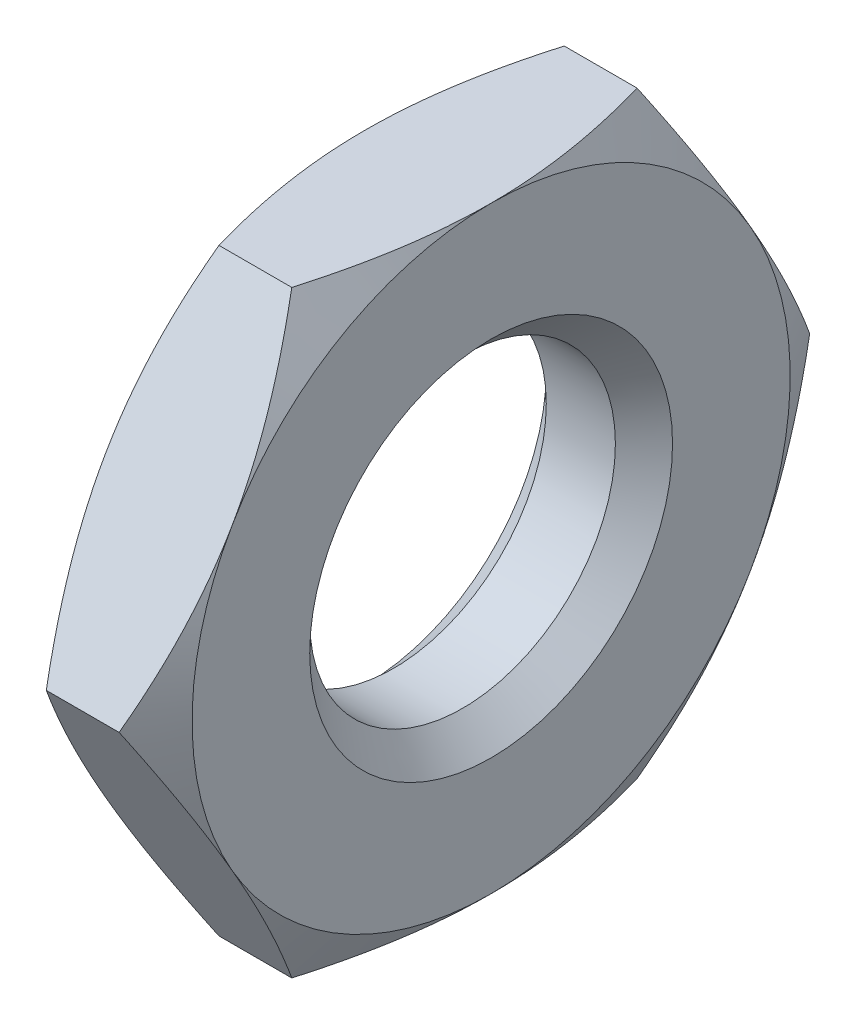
ISO-10303-21;
HEADER;
FILE_DESCRIPTION(('STEP AP214'),'2;1');
FILE_NAME('part.step','',(''),(''),'','','');
FILE_SCHEMA(('AUTOMOTIVE_DESIGN { 1 0 10303 214 1 1 1 1 }'));
ENDSEC;
DATA;
#1=APPLICATION_CONTEXT('core data for automotive mechanical design processes');
#2=APPLICATION_PROTOCOL_DEFINITION('international standard','automotive_design',2000,#1);
#3=PRODUCT_CONTEXT('',#1,'mechanical');
#4=PRODUCT('Part','Part','',(#3));
#5=PRODUCT_RELATED_PRODUCT_CATEGORY('part','',(#4));
#6=PRODUCT_DEFINITION_FORMATION('','',#4);
#7=PRODUCT_DEFINITION_CONTEXT('part definition',#1,'design');
#8=PRODUCT_DEFINITION('design','',#6,#7);
#9=PRODUCT_DEFINITION_SHAPE('','',#8);
#10=(LENGTH_UNIT() NAMED_UNIT(*) SI_UNIT(.MILLI.,.METRE.));
#11=(NAMED_UNIT(*) PLANE_ANGLE_UNIT() SI_UNIT($,.RADIAN.));
#12=(NAMED_UNIT(*) SI_UNIT($,.STERADIAN.) SOLID_ANGLE_UNIT());
#13=UNCERTAINTY_MEASURE_WITH_UNIT(LENGTH_MEASURE(1.E-05),#10,'distance_accuracy_value','');
#14=(GEOMETRIC_REPRESENTATION_CONTEXT(3) GLOBAL_UNCERTAINTY_ASSIGNED_CONTEXT((#13)) GLOBAL_UNIT_ASSIGNED_CONTEXT((#10,
#11,#12)) REPRESENTATION_CONTEXT('',''));
#15=CARTESIAN_POINT('',(0.,0.,0.));
#16=DIRECTION('',(0.,0.,1.));
#17=DIRECTION('',(1.,0.,0.));
#18=AXIS2_PLACEMENT_3D('',#15,#16,#17);
#19=CARTESIAN_POINT('',(0.95,2.25,-1.29903810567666));
#20=DIRECTION('',(1.,0.,0.));
#21=DIRECTION('',(0.,0.,-1.));
#22=AXIS2_PLACEMENT_3D('',#19,#20,#21);
#23=PLANE('',#22);
#24=CARTESIAN_POINT('',(0.95,0.,0.));
#25=DIRECTION('',(1.,0.,0.));
#26=DIRECTION('',(0.,0.,-1.));
#27=AXIS2_PLACEMENT_3D('',#24,#25,#26);
#28=CIRCLE('',#27,1.365);
#29=CARTESIAN_POINT('',(0.95,0.,-1.365));
#30=VERTEX_POINT('',#29);
#31=EDGE_CURVE('E11',#30,#30,#28,.F.);
#32=ORIENTED_EDGE('',*,*,#31,.T.);
#33=EDGE_LOOP('',(#32));
#34=FACE_BOUND('',#33,.T.);
#35=CARTESIAN_POINT('',(0.95,0.,0.));
#36=DIRECTION('',(1.,0.,0.));
#37=DIRECTION('',(0.,0.,-1.));
#38=AXIS2_PLACEMENT_3D('',#35,#36,#37);
#39=CIRCLE('',#38,2.25);
#40=CARTESIAN_POINT('',(0.95,-2.25,0.));
#41=VERTEX_POINT('',#40);
#42=CARTESIAN_POINT('',(0.95,-1.125,-1.94855715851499));
#43=VERTEX_POINT('',#42);
#44=EDGE_CURVE('E133',#41,#43,#39,.T.);
#45=ORIENTED_EDGE('',*,*,#44,.T.);
#46=CARTESIAN_POINT('',(0.95,1.125,-1.94855715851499));
#47=VERTEX_POINT('',#46);
#48=EDGE_CURVE('E122',#43,#47,#39,.T.);
#49=ORIENTED_EDGE('',*,*,#48,.T.);
#50=CARTESIAN_POINT('',(0.95,2.25,0.));
#51=VERTEX_POINT('',#50);
#52=EDGE_CURVE('E135',#47,#51,#39,.T.);
#53=ORIENTED_EDGE('',*,*,#52,.T.);
#54=CARTESIAN_POINT('',(0.95,1.125,1.94855715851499));
#55=VERTEX_POINT('',#54);
#56=EDGE_CURVE('E47',#51,#55,#39,.T.);
#57=ORIENTED_EDGE('',*,*,#56,.T.);
#58=CARTESIAN_POINT('',(0.95,-1.125,1.94855715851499));
#59=VERTEX_POINT('',#58);
#60=EDGE_CURVE('E55',#55,#59,#39,.T.);
#61=ORIENTED_EDGE('',*,*,#60,.T.);
#62=EDGE_CURVE('E155',#59,#41,#39,.T.);
#63=ORIENTED_EDGE('',*,*,#62,.T.);
#64=EDGE_LOOP('',(#45,#49,#53,#57,#61,#63));
#65=FACE_BOUND('',#64,.T.);
#66=ADVANCED_FACE('F32',(#34,#65),#23,.T.);
#67=CARTESIAN_POINT('',(0.,2.25,-1.29903810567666));
#68=DIRECTION('',(1.,0.,0.));
#69=DIRECTION('',(0.,0.,-1.));
#70=AXIS2_PLACEMENT_3D('',#67,#68,#69);
#71=PLANE('',#70);
#72=CARTESIAN_POINT('',(0.,0.,0.));
#73=DIRECTION('',(1.,0.,0.));
#74=DIRECTION('',(0.,0.,-1.));
#75=AXIS2_PLACEMENT_3D('',#72,#73,#74);
#76=CIRCLE('',#75,1.365);
#77=CARTESIAN_POINT('',(0.,0.,-1.365));
#78=VERTEX_POINT('',#77);
#79=EDGE_CURVE('E153',#78,#78,#76,.T.);
#80=ORIENTED_EDGE('',*,*,#79,.T.);
#81=EDGE_LOOP('',(#80));
#82=FACE_BOUND('',#81,.T.);
#83=CARTESIAN_POINT('',(0.,0.,0.));
#84=DIRECTION('',(1.,0.,0.));
#85=DIRECTION('',(0.,0.,-1.));
#86=AXIS2_PLACEMENT_3D('',#83,#84,#85);
#87=CIRCLE('',#86,2.25);
#88=CARTESIAN_POINT('',(0.,-1.125,-1.94855715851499));
#89=VERTEX_POINT('',#88);
#90=CARTESIAN_POINT('',(0.,1.125,-1.94855715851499));
#91=VERTEX_POINT('',#90);
#92=EDGE_CURVE('E157',#89,#91,#87,.T.);
#93=ORIENTED_EDGE('',*,*,#92,.F.);
#94=CARTESIAN_POINT('',(0.,-2.25,0.));
#95=VERTEX_POINT('',#94);
#96=EDGE_CURVE('E288',#95,#89,#87,.T.);
#97=ORIENTED_EDGE('',*,*,#96,.F.);
#98=CARTESIAN_POINT('',(0.,-1.125,1.94855715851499));
#99=VERTEX_POINT('',#98);
#100=EDGE_CURVE('E291',#99,#95,#87,.T.);
#101=ORIENTED_EDGE('',*,*,#100,.F.);
#102=CARTESIAN_POINT('',(0.,1.125,1.94855715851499));
#103=VERTEX_POINT('',#102);
#104=EDGE_CURVE('E294',#103,#99,#87,.T.);
#105=ORIENTED_EDGE('',*,*,#104,.F.);
#106=CARTESIAN_POINT('',(0.,2.25,0.));
#107=VERTEX_POINT('',#106);
#108=EDGE_CURVE('E161',#107,#103,#87,.T.);
#109=ORIENTED_EDGE('',*,*,#108,.F.);
#110=EDGE_CURVE('E158',#91,#107,#87,.T.);
#111=ORIENTED_EDGE('',*,*,#110,.F.);
#112=EDGE_LOOP('',(#93,#97,#101,#105,#109,#111));
#113=FACE_BOUND('',#112,.T.);
#114=ADVANCED_FACE('F289',(#82,#113),#71,.F.);
#115=CARTESIAN_POINT('',(0.95,0.,0.));
#116=DIRECTION('',(-1.,0.,0.));
#117=DIRECTION('',(0.,0.,1.));
#118=AXIS2_PLACEMENT_3D('',#115,#116,#117);
#119=CYLINDRICAL_SURFACE('',#118,1.15);
#120=CARTESIAN_POINT('',(0.214999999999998,0.,0.));
#121=DIRECTION('',(1.,0.,0.));
#122=DIRECTION('',(0.,0.,-1.));
#123=AXIS2_PLACEMENT_3D('',#120,#121,#122);
#124=CIRCLE('',#123,1.15);
#125=CARTESIAN_POINT('',(0.214999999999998,0.,1.15));
#126=VERTEX_POINT('',#125);
#127=EDGE_CURVE('E40',#126,#126,#124,.F.);
#128=CARTESIAN_POINT('',(0.734999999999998,0.,0.));
#129=DIRECTION('',(1.,0.,0.));
#130=DIRECTION('',(0.,0.,-1.));
#131=AXIS2_PLACEMENT_3D('',#128,#129,#130);
#132=CIRCLE('',#131,1.15);
#133=CARTESIAN_POINT('',(0.734999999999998,0.,1.15));
#134=VERTEX_POINT('',#133);
#135=EDGE_CURVE('E357',#134,#134,#132,.T.);
#136=CARTESIAN_POINT('',(0.214999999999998,0.,1.15));
#137=CARTESIAN_POINT('',(0.220416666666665,0.,1.15));
#138=CARTESIAN_POINT('',(0.225833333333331,0.,1.15));
#139=CARTESIAN_POINT('',(0.236666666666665,0.,1.15));
#140=CARTESIAN_POINT('',(0.242083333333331,0.,1.15));
#141=CARTESIAN_POINT('',(0.252916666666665,0.,1.15));
#142=CARTESIAN_POINT('',(0.258333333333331,0.,1.15));
#143=CARTESIAN_POINT('',(0.269166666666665,0.,1.15));
#144=CARTESIAN_POINT('',(0.274583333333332,0.,1.15));
#145=CARTESIAN_POINT('',(0.285416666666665,0.,1.15));
#146=CARTESIAN_POINT('',(0.290833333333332,0.,1.15));
#147=CARTESIAN_POINT('',(0.301666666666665,0.,1.15));
#148=CARTESIAN_POINT('',(0.307083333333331,0.,1.15));
#149=CARTESIAN_POINT('',(0.317916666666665,0.,1.15));
#150=CARTESIAN_POINT('',(0.323333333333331,0.,1.15));
#151=CARTESIAN_POINT('',(0.334166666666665,0.,1.15));
#152=CARTESIAN_POINT('',(0.339583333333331,0.,1.15));
#153=CARTESIAN_POINT('',(0.350416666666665,0.,1.15));
#154=CARTESIAN_POINT('',(0.355833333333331,0.,1.15));
#155=CARTESIAN_POINT('',(0.366666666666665,0.,1.15));
#156=CARTESIAN_POINT('',(0.372083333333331,0.,1.15));
#157=CARTESIAN_POINT('',(0.382916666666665,0.,1.15));
#158=CARTESIAN_POINT('',(0.388333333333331,0.,1.15));
#159=CARTESIAN_POINT('',(0.399166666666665,0.,1.15));
#160=CARTESIAN_POINT('',(0.404583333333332,0.,1.15));
#161=CARTESIAN_POINT('',(0.415416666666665,0.,1.15));
#162=CARTESIAN_POINT('',(0.420833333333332,0.,1.15));
#163=CARTESIAN_POINT('',(0.431666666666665,0.,1.15));
#164=CARTESIAN_POINT('',(0.437083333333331,0.,1.15));
#165=CARTESIAN_POINT('',(0.447916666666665,0.,1.15));
#166=CARTESIAN_POINT('',(0.453333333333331,0.,1.15));
#167=CARTESIAN_POINT('',(0.464166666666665,0.,1.15));
#168=CARTESIAN_POINT('',(0.469583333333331,0.,1.15));
#169=CARTESIAN_POINT('',(0.480416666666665,0.,1.15));
#170=CARTESIAN_POINT('',(0.485833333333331,0.,1.15));
#171=CARTESIAN_POINT('',(0.496666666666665,0.,1.15));
#172=CARTESIAN_POINT('',(0.502083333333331,0.,1.15));
#173=CARTESIAN_POINT('',(0.512916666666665,0.,1.15));
#174=CARTESIAN_POINT('',(0.518333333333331,0.,1.15));
#175=CARTESIAN_POINT('',(0.529166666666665,0.,1.15));
#176=CARTESIAN_POINT('',(0.534583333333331,0.,1.15));
#177=CARTESIAN_POINT('',(0.545416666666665,0.,1.15));
#178=CARTESIAN_POINT('',(0.550833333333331,0.,1.15));
#179=CARTESIAN_POINT('',(0.561666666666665,0.,1.15));
#180=CARTESIAN_POINT('',(0.567083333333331,0.,1.15));
#181=CARTESIAN_POINT('',(0.577916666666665,0.,1.15));
#182=CARTESIAN_POINT('',(0.583333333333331,0.,1.15));
#183=CARTESIAN_POINT('',(0.594166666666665,0.,1.15));
#184=CARTESIAN_POINT('',(0.599583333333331,0.,1.15));
#185=CARTESIAN_POINT('',(0.610416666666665,0.,1.15));
#186=CARTESIAN_POINT('',(0.615833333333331,0.,1.15));
#187=CARTESIAN_POINT('',(0.626666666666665,0.,1.15));
#188=CARTESIAN_POINT('',(0.632083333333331,0.,1.15));
#189=CARTESIAN_POINT('',(0.642916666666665,0.,1.15));
#190=CARTESIAN_POINT('',(0.648333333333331,0.,1.15));
#191=CARTESIAN_POINT('',(0.659166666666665,0.,1.15));
#192=CARTESIAN_POINT('',(0.664583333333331,0.,1.15));
#193=CARTESIAN_POINT('',(0.675416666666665,0.,1.15));
#194=CARTESIAN_POINT('',(0.680833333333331,0.,1.15));
#195=CARTESIAN_POINT('',(0.691666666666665,0.,1.15));
#196=CARTESIAN_POINT('',(0.697083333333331,0.,1.15));
#197=CARTESIAN_POINT('',(0.707916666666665,0.,1.15));
#198=CARTESIAN_POINT('',(0.713333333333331,0.,1.15));
#199=CARTESIAN_POINT('',(0.724166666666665,0.,1.15));
#200=CARTESIAN_POINT('',(0.729583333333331,0.,1.15));
#201=CARTESIAN_POINT('',(0.734999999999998,0.,1.15));
#202=B_SPLINE_CURVE_WITH_KNOTS('',3,(#136,#137,#138,#139,#140,#141,#142,#143,#144,#145,#146,
#147,#148,#149,#150,#151,#152,#153,#154,#155,#156,#157,#158,#159,#160,#161,#162,#163,#164,#165,
#166,#167,#168,#169,#170,#171,#172,#173,#174,#175,#176,#177,#178,#179,#180,#181,#182,#183,#184,
#185,#186,#187,#188,#189,#190,#191,#192,#193,#194,#195,#196,#197,#198,#199,#200,#201),
.UNSPECIFIED.,.F.,.F.,(4,2,2,2,2,2,2,2,2,2,2,2,2,2,2,2,2,2,2,2,2,2,2,2,2,2,2,2,2,2,2,2,4),(0.,
0.01625,0.0325,0.04875,0.0649999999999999,0.0812499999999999,0.0974999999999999,0.11375,0.13,
0.14625,0.1625,0.17875,0.195,0.21125,0.2275,0.24375,0.26,0.27625,0.2925,0.30875,0.325,0.34125,
0.3575,0.37375,0.39,0.40625,0.4225,0.43875,0.455,0.47125,0.4875,0.50375,0.52),.UNSPECIFIED.);
#203=EDGE_CURVE('BSEAM215',#126,#134,#202,.T.);
#204=ORIENTED_EDGE('',*,*,#127,.T.);
#205=ORIENTED_EDGE('',*,*,#135,.T.);
#206=ORIENTED_EDGE('',*,*,#203,.T.);
#207=ORIENTED_EDGE('',*,*,#203,.F.);
#208=EDGE_LOOP('',(#204,#206,#205,#207));
#209=FACE_BOUND('',#208,.T.);
#210=ADVANCED_FACE('F215',(#209),#119,.F.);
#211=CARTESIAN_POINT('',(0.,0.,0.));
#212=DIRECTION('',(1.,0.,0.));
#213=DIRECTION('',(0.,0.,-1.));
#214=AXIS2_PLACEMENT_3D('',#211,#212,#213);
#215=CONICAL_SURFACE('',#214,2.25,1.0471975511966);
#216=CARTESIAN_POINT('',(0.201028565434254,-2.2502,-1.29892263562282));
#217=CARTESIAN_POINT('',(0.168055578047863,-2.15132275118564,-1.35600944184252));
#218=CARTESIAN_POINT('',(0.138067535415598,-2.05159200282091,-1.41358901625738));
#219=CARTESIAN_POINT('',(0.0857223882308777,-1.85040345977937,-1.52974527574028));
#220=CARTESIAN_POINT('',(0.0633838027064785,-1.74894208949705,-1.58832402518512));
#221=CARTESIAN_POINT('',(0.0286095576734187,-1.54727681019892,-1.7047555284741));
#222=CARTESIAN_POINT('',(0.0159424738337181,-1.44710393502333,-1.76259036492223));
#223=CARTESIAN_POINT('',(0.000818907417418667,-1.24628668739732,-1.87853225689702));
#224=CARTESIAN_POINT('',(-0.00165009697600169,-1.1456430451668,-1.93663889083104));
#225=CARTESIAN_POINT('',(0.003478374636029,-0.957574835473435,-2.04522012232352));
#226=CARTESIAN_POINT('',(0.00981663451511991,-0.870122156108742,-2.09571095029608));
#227=CARTESIAN_POINT('',(0.0299076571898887,-0.695786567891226,-2.19636364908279));
#228=CARTESIAN_POINT('',(0.0436672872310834,-0.608904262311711,-2.24652517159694));
#229=CARTESIAN_POINT('',(0.0780662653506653,-0.434209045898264,-2.34738550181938));
#230=CARTESIAN_POINT('',(0.0988514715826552,-0.346418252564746,-2.39807153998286));
#231=CARTESIAN_POINT('',(0.146026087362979,-0.172146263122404,-2.49868751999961));
#232=CARTESIAN_POINT('',(0.172404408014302,-0.0856628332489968,-2.54861875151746));
#233=CARTESIAN_POINT('',(0.201028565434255,0.00020000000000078,-2.59819168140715));
#234=B_SPLINE_CURVE_WITH_KNOTS('',3,(#216,#217,#218,#219,#220,#221,#222,#223,#224,#225,#226,
#227,#228,#229,#230,#231,#232,#233),.UNSPECIFIED.,.F.,.F.,(4,2,2,2,2,2,2,2,4),(0.,
0.356658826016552,0.714175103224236,1.06284241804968,1.41108149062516,1.71433394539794,
2.01786749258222,2.32813511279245,2.63779325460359),.UNSPECIFIED.);
#235=CARTESIAN_POINT('',(0.200961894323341,0.,-2.59807621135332));
#236=VERTEX_POINT('',#235);
#237=EDGE_CURVE('E299',#89,#236,#234,.T.);
#238=ORIENTED_EDGE('',*,*,#237,.F.);
#239=ORIENTED_EDGE('',*,*,#92,.T.);
#240=CARTESIAN_POINT('',(0.201028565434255,-0.000199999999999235,-2.59819168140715));
#241=CARTESIAN_POINT('',(0.168055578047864,0.098677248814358,-2.54110487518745));
#242=CARTESIAN_POINT('',(0.138067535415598,0.198407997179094,-2.48352530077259));
#243=CARTESIAN_POINT('',(0.085722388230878,0.399596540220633,-2.36736904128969));
#244=CARTESIAN_POINT('',(0.0633838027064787,0.501057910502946,-2.30879029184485));
#245=CARTESIAN_POINT('',(0.0286095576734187,0.702723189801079,-2.19235878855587));
#246=CARTESIAN_POINT('',(0.0159424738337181,0.802896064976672,-2.13452395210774));
#247=CARTESIAN_POINT('',(0.000818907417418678,1.00371331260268,-2.01858206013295));
#248=CARTESIAN_POINT('',(-0.00165009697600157,1.1043569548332,-1.96047542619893));
#249=CARTESIAN_POINT('',(0.00347837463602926,1.29242516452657,-1.85189419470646));
#250=CARTESIAN_POINT('',(0.0098166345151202,1.37987784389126,-1.8014033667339));
#251=CARTESIAN_POINT('',(0.0299076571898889,1.55421343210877,-1.70075066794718));
#252=CARTESIAN_POINT('',(0.0436672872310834,1.64109573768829,-1.65058914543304));
#253=CARTESIAN_POINT('',(0.0780662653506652,1.81579095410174,-1.54972881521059));
#254=CARTESIAN_POINT('',(0.0988514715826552,1.90358174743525,-1.49904277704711));
#255=CARTESIAN_POINT('',(0.146026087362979,2.07785373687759,-1.39842679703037));
#256=CARTESIAN_POINT('',(0.172404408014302,2.164337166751,-1.34849556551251));
#257=CARTESIAN_POINT('',(0.201028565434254,2.2502,-1.29892263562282));
#258=B_SPLINE_CURVE_WITH_KNOTS('',3,(#240,#241,#242,#243,#244,#245,#246,#247,#248,#249,#250,
#251,#252,#253,#254,#255,#256,#257),.UNSPECIFIED.,.F.,.F.,(4,2,2,2,2,2,2,2,4),(0.,
0.356658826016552,0.714175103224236,1.06284241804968,1.41108149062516,1.71433394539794,
2.01786749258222,2.32813511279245,2.63779325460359),.UNSPECIFIED.);
#259=EDGE_CURVE('E196',#236,#91,#258,.T.);
#260=ORIENTED_EDGE('',*,*,#259,.F.);
#261=EDGE_LOOP('',(#238,#239,#260));
#262=FACE_BOUND('',#261,.T.);
#263=ADVANCED_FACE('F176',(#262),#215,.T.);
#264=ORIENTED_EDGE('',*,*,#96,.T.);
#265=CARTESIAN_POINT('',(0.200961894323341,-2.25,-1.29903810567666));
#266=VERTEX_POINT('',#265);
#267=EDGE_CURVE('E146',#266,#89,#234,.T.);
#268=ORIENTED_EDGE('',*,*,#267,.F.);
#269=CARTESIAN_POINT('',(1.09515937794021,-2.25,-3.48339558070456));
#270=CARTESIAN_POINT('',(1.04753772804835,-2.25,-3.38517513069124));
#271=CARTESIAN_POINT('',(1.00037441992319,-2.25,-3.28672856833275));
#272=CARTESIAN_POINT('',(0.907222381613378,-2.25,-3.0892629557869));
#273=CARTESIAN_POINT('',(0.861233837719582,-2.25,-2.99024381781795));
#274=CARTESIAN_POINT('',(0.770456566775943,-2.25,-2.79099972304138));
#275=CARTESIAN_POINT('',(0.725675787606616,-2.25,-2.69077113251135));
#276=CARTESIAN_POINT('',(0.63795475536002,-2.25,-2.48951469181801));
#277=CARTESIAN_POINT('',(0.595014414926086,-2.25,-2.3884868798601));
#278=CARTESIAN_POINT('',(0.510126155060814,-2.25,-2.18222958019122));
#279=CARTESIAN_POINT('',(0.468253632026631,-2.25,-2.07696889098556));
#280=CARTESIAN_POINT('',(0.387692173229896,-2.25,-1.86521378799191));
#281=CARTESIAN_POINT('',(0.349003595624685,-2.25,-1.75871923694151));
#282=CARTESIAN_POINT('',(0.275830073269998,-2.25,-1.54452830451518));
#283=CARTESIAN_POINT('',(0.241336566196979,-2.25,-1.43683487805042));
#284=CARTESIAN_POINT('',(0.177664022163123,-2.25,-1.21990320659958));
#285=CARTESIAN_POINT('',(0.148483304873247,-2.25,-1.11066546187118));
#286=CARTESIAN_POINT('',(0.096996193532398,-2.25,-0.891190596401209));
#287=CARTESIAN_POINT('',(0.0746526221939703,-2.25,-0.780962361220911));
#288=CARTESIAN_POINT('',(0.0381060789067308,-2.25,-0.559141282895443));
#289=CARTESIAN_POINT('',(0.0239023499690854,-2.25,-0.447548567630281));
#290=CARTESIAN_POINT('',(0.00495462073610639,-2.25,-0.225010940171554));
#291=CARTESIAN_POINT('',(8.9504677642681E-05,-2.25,-0.114076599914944));
#292=CARTESIAN_POINT('',(-8.69843550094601E-05,-2.25,0.107808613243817));
#293=CARTESIAN_POINT('',(0.00460183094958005,-2.25,0.218759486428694));
#294=CARTESIAN_POINT('',(0.0203569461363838,-2.25,0.407300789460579));
#295=CARTESIAN_POINT('',(0.0291386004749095,-2.25,0.485093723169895));
#296=CARTESIAN_POINT('',(0.0508485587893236,-2.25,0.640104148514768));
#297=CARTESIAN_POINT('',(0.0637774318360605,-2.25,0.71732155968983));
#298=CARTESIAN_POINT('',(0.108106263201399,-2.25,0.94800218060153));
#299=CARTESIAN_POINT('',(0.145040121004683,-2.25,1.10040586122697));
#300=CARTESIAN_POINT('',(0.230601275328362,-2.25,1.40538758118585));
#301=CARTESIAN_POINT('',(0.279467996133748,-2.25,1.55789566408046));
#302=CARTESIAN_POINT('',(0.38500480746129,-2.25,1.86009764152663));
#303=CARTESIAN_POINT('',(0.441672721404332,-2.25,2.00979230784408));
#304=CARTESIAN_POINT('',(0.540622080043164,-2.25,2.25734757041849));
#305=CARTESIAN_POINT('',(0.581388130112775,-2.25,2.35582380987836));
#306=CARTESIAN_POINT('',(0.664851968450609,-2.25,2.55195610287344));
#307=CARTESIAN_POINT('',(0.707549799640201,-2.25,2.64961213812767));
#308=CARTESIAN_POINT('',(0.837950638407,-2.25,2.94159317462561));
#309=CARTESIAN_POINT('',(0.927945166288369,-2.25,3.13489245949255));
#310=CARTESIAN_POINT('',(1.11201833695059,-2.25,3.51974780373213));
#311=CARTESIAN_POINT('',(1.20610087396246,-2.25,3.71130198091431));
#312=CARTESIAN_POINT('',(1.39702905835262,-2.25,4.09303245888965));
#313=CARTESIAN_POINT('',(1.49387479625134,-2.25,4.28320871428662));
#314=CARTESIAN_POINT('',(1.68154183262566,-2.25,4.64706067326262));
#315=CARTESIAN_POINT('',(1.77220945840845,-2.25,4.82081590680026));
#316=CARTESIAN_POINT('',(1.95479522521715,-2.25,5.16767471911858));
#317=CARTESIAN_POINT('',(2.04671340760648,-2.25,5.34077827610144));
#318=CARTESIAN_POINT('',(2.23128403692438,-2.25,5.68606019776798));
#319=CARTESIAN_POINT('',(2.32393419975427,-2.25,5.85823978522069));
#320=CARTESIAN_POINT('',(2.50998657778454,-2.25,6.20218051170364));
#321=CARTESIAN_POINT('',(2.60338875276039,-2.25,6.37394167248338));
#322=CARTESIAN_POINT('',(2.69707247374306,-2.25,6.54554805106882));
#323=B_SPLINE_CURVE_WITH_KNOTS('',3,(#269,#270,#271,#272,#273,#274,#275,#276,#277,#278,#279,
#280,#281,#282,#283,#284,#285,#286,#287,#288,#289,#290,#291,#292,#293,#294,#295,#296,#297,#298,
#299,#300,#301,#302,#303,#304,#305,#306,#307,#308,#309,#310,#311,#312,#313,#314,#315,#316,#317,
#318,#319,#320,#321,#322),.UNSPECIFIED.,.F.,.F.,(4,2,2,2,2,2,2,2,2,2,2,2,2,2,2,2,2,2,2,2,2,2,2,
2,2,2,4),(0.,0.327472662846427,0.654996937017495,0.984314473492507,1.31361636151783,
1.65342665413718,1.99327511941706,2.33241786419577,2.67145315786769,3.00861075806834,
3.34573699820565,3.67846057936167,4.01119071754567,4.24593859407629,4.48071869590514,
4.9505425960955,5.43070470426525,5.91073311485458,6.2304559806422,6.55018595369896,
7.18977111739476,7.82997951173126,8.47020890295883,9.05816850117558,9.64614759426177,
10.2327193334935,10.819259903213),.UNSPECIFIED.);
#324=EDGE_CURVE('E160',#95,#266,#323,.F.);
#325=ORIENTED_EDGE('',*,*,#324,.F.);
#326=EDGE_LOOP('',(#264,#268,#325));
#327=FACE_BOUND('',#326,.T.);
#328=ADVANCED_FACE('F312',(#327),#215,.T.);
#329=CARTESIAN_POINT('',(0.475,0.,0.));
#330=DIRECTION('',(-1.,0.,0.));
#331=DIRECTION('',(0.,0.,1.));
#332=AXIS2_PLACEMENT_3D('',#329,#330,#331);
#333=CONICAL_SURFACE('',#332,3.07272413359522,1.0471975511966);
#334=CARTESIAN_POINT('',(0.748971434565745,0.000200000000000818,-2.59819168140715));
#335=CARTESIAN_POINT('',(0.781944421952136,-0.0986772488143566,-2.54110487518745));
#336=CARTESIAN_POINT('',(0.811932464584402,-0.198407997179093,-2.48352530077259));
#337=CARTESIAN_POINT('',(0.864277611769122,-0.399596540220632,-2.36736904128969));
#338=CARTESIAN_POINT('',(0.886616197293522,-0.501057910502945,-2.30879029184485));
#339=CARTESIAN_POINT('',(0.921390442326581,-0.702723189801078,-2.19235878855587));
#340=CARTESIAN_POINT('',(0.934057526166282,-0.802896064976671,-2.13452395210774));
#341=CARTESIAN_POINT('',(0.949181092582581,-1.00371331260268,-2.01858206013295));
#342=CARTESIAN_POINT('',(0.951650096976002,-1.1043569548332,-1.96047542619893));
#343=CARTESIAN_POINT('',(0.946521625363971,-1.29242516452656,-1.85189419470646));
#344=CARTESIAN_POINT('',(0.94018336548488,-1.37987784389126,-1.8014033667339));
#345=CARTESIAN_POINT('',(0.920092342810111,-1.55421343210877,-1.70075066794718));
#346=CARTESIAN_POINT('',(0.906332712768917,-1.64109573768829,-1.65058914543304));
#347=CARTESIAN_POINT('',(0.871933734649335,-1.81579095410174,-1.54972881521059));
#348=CARTESIAN_POINT('',(0.851148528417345,-1.90358174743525,-1.49904277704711));
#349=CARTESIAN_POINT('',(0.803973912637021,-2.07785373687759,-1.39842679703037));
#350=CARTESIAN_POINT('',(0.777595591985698,-2.164337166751,-1.34849556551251));
#351=CARTESIAN_POINT('',(0.748971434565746,-2.2502,-1.29892263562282));
#352=B_SPLINE_CURVE_WITH_KNOTS('',3,(#334,#335,#336,#337,#338,#339,#340,#341,#342,#343,#344,
#345,#346,#347,#348,#349,#350,#351),.UNSPECIFIED.,.F.,.F.,(4,2,2,2,2,2,2,2,4),(0.,
0.356658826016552,0.714175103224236,1.06284241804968,1.41108149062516,1.71433394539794,
2.01786749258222,2.32813511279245,2.63779325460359),.UNSPECIFIED.);
#353=CARTESIAN_POINT('',(0.749038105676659,-2.25,-1.29903810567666));
#354=VERTEX_POINT('',#353);
#355=EDGE_CURVE('E138',#43,#354,#352,.T.);
#356=ORIENTED_EDGE('',*,*,#355,.F.);
#357=ORIENTED_EDGE('',*,*,#44,.F.);
#358=CARTESIAN_POINT('',(-0.145159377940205,-2.25,-3.48339558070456));
#359=CARTESIAN_POINT('',(-0.0975377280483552,-2.25,-3.38517513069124));
#360=CARTESIAN_POINT('',(-0.050374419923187,-2.25,-3.28672856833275));
#361=CARTESIAN_POINT('',(0.0427776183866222,-2.25,-3.0892629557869));
#362=CARTESIAN_POINT('',(0.0887661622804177,-2.25,-2.99024381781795));
#363=CARTESIAN_POINT('',(0.179543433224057,-2.25,-2.79099972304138));
#364=CARTESIAN_POINT('',(0.224324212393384,-2.25,-2.69077113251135));
#365=CARTESIAN_POINT('',(0.31204524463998,-2.25,-2.48951469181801));
#366=CARTESIAN_POINT('',(0.354985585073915,-2.25,-2.3884868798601));
#367=CARTESIAN_POINT('',(0.439873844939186,-2.25,-2.18222958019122));
#368=CARTESIAN_POINT('',(0.481746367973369,-2.25,-2.07696889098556));
#369=CARTESIAN_POINT('',(0.562307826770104,-2.25,-1.86521378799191));
#370=CARTESIAN_POINT('',(0.600996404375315,-2.25,-1.75871923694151));
#371=CARTESIAN_POINT('',(0.674169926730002,-2.25,-1.54452830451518));
#372=CARTESIAN_POINT('',(0.708663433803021,-2.25,-1.43683487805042));
#373=CARTESIAN_POINT('',(0.772335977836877,-2.25,-1.21990320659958));
#374=CARTESIAN_POINT('',(0.801516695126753,-2.25,-1.11066546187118));
#375=CARTESIAN_POINT('',(0.853003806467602,-2.25,-0.891190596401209));
#376=CARTESIAN_POINT('',(0.87534737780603,-2.25,-0.780962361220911));
#377=CARTESIAN_POINT('',(0.911893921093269,-2.25,-0.559141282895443));
#378=CARTESIAN_POINT('',(0.926097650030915,-2.25,-0.447548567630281));
#379=CARTESIAN_POINT('',(0.945045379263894,-2.25,-0.225010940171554));
#380=CARTESIAN_POINT('',(0.949910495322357,-2.25,-0.114076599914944));
#381=CARTESIAN_POINT('',(0.95008698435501,-2.25,0.107808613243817));
#382=CARTESIAN_POINT('',(0.94539816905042,-2.25,0.218759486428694));
#383=CARTESIAN_POINT('',(0.929643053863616,-2.25,0.407300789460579));
#384=CARTESIAN_POINT('',(0.920861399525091,-2.25,0.485093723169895));
#385=CARTESIAN_POINT('',(0.899151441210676,-2.25,0.640104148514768));
#386=CARTESIAN_POINT('',(0.88622256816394,-2.25,0.71732155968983));
#387=CARTESIAN_POINT('',(0.841893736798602,-2.25,0.94800218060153));
#388=CARTESIAN_POINT('',(0.804959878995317,-2.25,1.10040586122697));
#389=CARTESIAN_POINT('',(0.719398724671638,-2.25,1.40538758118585));
#390=CARTESIAN_POINT('',(0.670532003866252,-2.25,1.55789566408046));
#391=CARTESIAN_POINT('',(0.56499519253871,-2.25,1.86009764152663));
#392=CARTESIAN_POINT('',(0.508327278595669,-2.25,2.00979230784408));
#393=CARTESIAN_POINT('',(0.409377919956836,-2.25,2.25734757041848));
#394=CARTESIAN_POINT('',(0.368611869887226,-2.25,2.35582380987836));
#395=CARTESIAN_POINT('',(0.285148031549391,-2.25,2.55195610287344));
#396=CARTESIAN_POINT('',(0.2424502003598,-2.25,2.64961213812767));
#397=CARTESIAN_POINT('',(0.112049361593,-2.25,2.94159317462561));
#398=CARTESIAN_POINT('',(0.0220548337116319,-2.25,3.13489245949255));
#399=CARTESIAN_POINT('',(-0.162018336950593,-2.25,3.51974780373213));
#400=CARTESIAN_POINT('',(-0.256100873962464,-2.25,3.71130198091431));
#401=CARTESIAN_POINT('',(-0.44702905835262,-2.25,4.09303245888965));
#402=CARTESIAN_POINT('',(-0.543874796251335,-2.25,4.28320871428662));
#403=CARTESIAN_POINT('',(-0.731541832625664,-2.25,4.64706067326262));
#404=CARTESIAN_POINT('',(-0.822209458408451,-2.25,4.82081590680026));
#405=CARTESIAN_POINT('',(-1.00479522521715,-2.25,5.16767471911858));
#406=CARTESIAN_POINT('',(-1.09671340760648,-2.25,5.34077827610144));
#407=CARTESIAN_POINT('',(-1.28128403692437,-2.25,5.68606019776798));
#408=CARTESIAN_POINT('',(-1.37393419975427,-2.25,5.85823978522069));
#409=CARTESIAN_POINT('',(-1.55998657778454,-2.25,6.20218051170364));
#410=CARTESIAN_POINT('',(-1.65338875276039,-2.25,6.37394167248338));
#411=CARTESIAN_POINT('',(-1.74707247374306,-2.25,6.54554805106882));
#412=B_SPLINE_CURVE_WITH_KNOTS('',3,(#358,#359,#360,#361,#362,#363,#364,#365,#366,#367,#368,
#369,#370,#371,#372,#373,#374,#375,#376,#377,#378,#379,#380,#381,#382,#383,#384,#385,#386,#387,
#388,#389,#390,#391,#392,#393,#394,#395,#396,#397,#398,#399,#400,#401,#402,#403,#404,#405,#406,
#407,#408,#409,#410,#411),.UNSPECIFIED.,.F.,.F.,(4,2,2,2,2,2,2,2,2,2,2,2,2,2,2,2,2,2,2,2,2,2,2,
2,2,2,4),(0.,0.327472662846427,0.654996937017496,0.984314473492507,1.31361636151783,
1.65342665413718,1.99327511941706,2.33241786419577,2.67145315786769,3.00861075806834,
3.34573699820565,3.67846057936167,4.01119071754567,4.24593859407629,4.48071869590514,
4.9505425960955,5.43070470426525,5.91073311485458,6.2304559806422,6.55018595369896,
7.18977111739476,7.82997951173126,8.47020890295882,9.05816850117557,9.64614759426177,
10.2327193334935,10.819259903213),.UNSPECIFIED.);
#413=EDGE_CURVE('E142',#354,#41,#412,.T.);
#414=ORIENTED_EDGE('',*,*,#413,.F.);
#415=EDGE_LOOP('',(#356,#357,#414));
#416=FACE_BOUND('',#415,.T.);
#417=ADVANCED_FACE('F139',(#416),#333,.T.);
#418=ORIENTED_EDGE('',*,*,#48,.F.);
#419=CARTESIAN_POINT('',(0.749038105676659,0.,-2.59807621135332));
#420=VERTEX_POINT('',#419);
#421=EDGE_CURVE('E126',#420,#43,#352,.T.);
#422=ORIENTED_EDGE('',*,*,#421,.F.);
#423=CARTESIAN_POINT('',(0.748971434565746,2.2502,-1.29892263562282));
#424=CARTESIAN_POINT('',(0.781944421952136,2.15132275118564,-1.35600944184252));
#425=CARTESIAN_POINT('',(0.811932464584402,2.05159200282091,-1.41358901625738));
#426=CARTESIAN_POINT('',(0.864277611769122,1.85040345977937,-1.52974527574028));
#427=CARTESIAN_POINT('',(0.886616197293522,1.74894208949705,-1.58832402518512));
#428=CARTESIAN_POINT('',(0.921390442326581,1.54727681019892,-1.7047555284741));
#429=CARTESIAN_POINT('',(0.934057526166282,1.44710393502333,-1.76259036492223));
#430=CARTESIAN_POINT('',(0.949181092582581,1.24628668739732,-1.87853225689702));
#431=CARTESIAN_POINT('',(0.951650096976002,1.1456430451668,-1.93663889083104));
#432=CARTESIAN_POINT('',(0.946521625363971,0.957574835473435,-2.04522012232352));
#433=CARTESIAN_POINT('',(0.94018336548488,0.870122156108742,-2.09571095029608));
#434=CARTESIAN_POINT('',(0.920092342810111,0.695786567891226,-2.19636364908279));
#435=CARTESIAN_POINT('',(0.906332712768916,0.608904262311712,-2.24652517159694));
#436=CARTESIAN_POINT('',(0.871933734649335,0.434209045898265,-2.34738550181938));
#437=CARTESIAN_POINT('',(0.851148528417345,0.346418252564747,-2.39807153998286));
#438=CARTESIAN_POINT('',(0.803973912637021,0.172146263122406,-2.49868751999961));
#439=CARTESIAN_POINT('',(0.777595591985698,0.0856628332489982,-2.54861875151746));
#440=CARTESIAN_POINT('',(0.748971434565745,-0.000199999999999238,-2.59819168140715));
#441=B_SPLINE_CURVE_WITH_KNOTS('',3,(#423,#424,#425,#426,#427,#428,#429,#430,#431,#432,#433,
#434,#435,#436,#437,#438,#439,#440),.UNSPECIFIED.,.F.,.F.,(4,2,2,2,2,2,2,2,4),(0.,
0.356658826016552,0.714175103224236,1.06284241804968,1.41108149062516,1.71433394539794,
2.01786749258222,2.32813511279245,2.63779325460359),.UNSPECIFIED.);
#442=EDGE_CURVE('E128',#47,#420,#441,.T.);
#443=ORIENTED_EDGE('',*,*,#442,.F.);
#444=EDGE_LOOP('',(#418,#422,#443));
#445=FACE_BOUND('',#444,.T.);
#446=ADVANCED_FACE('F124',(#445),#333,.T.);
#447=ORIENTED_EDGE('',*,*,#100,.T.);
#448=CARTESIAN_POINT('',(0.20096189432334,-2.25,1.29903810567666));
#449=VERTEX_POINT('',#448);
#450=EDGE_CURVE('E169',#449,#95,#323,.F.);
#451=ORIENTED_EDGE('',*,*,#450,.F.);
#452=CARTESIAN_POINT('',(0.201028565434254,0.000200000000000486,2.59819168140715));
#453=CARTESIAN_POINT('',(0.168055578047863,-0.0986772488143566,2.54110487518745));
#454=CARTESIAN_POINT('',(0.138067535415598,-0.198407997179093,2.48352530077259));
#455=CARTESIAN_POINT('',(0.0857223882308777,-0.399596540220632,2.36736904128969));
#456=CARTESIAN_POINT('',(0.0633838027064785,-0.501057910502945,2.30879029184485));
#457=CARTESIAN_POINT('',(0.0286095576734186,-0.702723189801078,2.19235878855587));
#458=CARTESIAN_POINT('',(0.015942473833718,-0.802896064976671,2.13452395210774));
#459=CARTESIAN_POINT('',(0.000818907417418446,-1.00371331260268,2.01858206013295));
#460=CARTESIAN_POINT('',(-0.00165009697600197,-1.1043569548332,1.96047542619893));
#461=CARTESIAN_POINT('',(0.00347837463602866,-1.29242516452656,1.85189419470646));
#462=CARTESIAN_POINT('',(0.00981663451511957,-1.37987784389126,1.8014033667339));
#463=CARTESIAN_POINT('',(0.0299076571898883,-1.55421343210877,1.70075066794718));
#464=CARTESIAN_POINT('',(0.0436672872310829,-1.64109573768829,1.65058914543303));
#465=CARTESIAN_POINT('',(0.0780662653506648,-1.81579095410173,1.54972881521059));
#466=CARTESIAN_POINT('',(0.0988514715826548,-1.90358174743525,1.49904277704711));
#467=CARTESIAN_POINT('',(0.146026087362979,-2.07785373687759,1.39842679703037));
#468=CARTESIAN_POINT('',(0.172404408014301,-2.164337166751,1.34849556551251));
#469=CARTESIAN_POINT('',(0.201028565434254,-2.2502,1.29892263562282));
#470=B_SPLINE_CURVE_WITH_KNOTS('',3,(#452,#453,#454,#455,#456,#457,#458,#459,#460,#461,#462,
#463,#464,#465,#466,#467,#468,#469),.UNSPECIFIED.,.F.,.F.,(4,2,2,2,2,2,2,2,4),(0.,
0.356658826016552,0.714175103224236,1.06284241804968,1.41108149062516,1.71433394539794,
2.01786749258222,2.32813511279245,2.63779325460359),.UNSPECIFIED.);
#471=EDGE_CURVE('E170',#99,#449,#470,.T.);
#472=ORIENTED_EDGE('',*,*,#471,.F.);
#473=EDGE_LOOP('',(#447,#451,#472));
#474=FACE_BOUND('',#473,.T.);
#475=ADVANCED_FACE('F311',(#474),#215,.T.);
#476=CARTESIAN_POINT('',(0.74903810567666,-2.25,1.29903810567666));
#477=VERTEX_POINT('',#476);
#478=EDGE_CURVE('E197',#41,#477,#412,.T.);
#479=ORIENTED_EDGE('',*,*,#478,.F.);
#480=ORIENTED_EDGE('',*,*,#62,.F.);
#481=CARTESIAN_POINT('',(0.748971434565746,-2.2502,1.29892263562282));
#482=CARTESIAN_POINT('',(0.781944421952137,-2.15132275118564,1.35600944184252));
#483=CARTESIAN_POINT('',(0.811932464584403,-2.05159200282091,1.41358901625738));
#484=CARTESIAN_POINT('',(0.864277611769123,-1.85040345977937,1.52974527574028));
#485=CARTESIAN_POINT('',(0.886616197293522,-1.74894208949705,1.58832402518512));
#486=CARTESIAN_POINT('',(0.921390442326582,-1.54727681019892,1.7047555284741));
#487=CARTESIAN_POINT('',(0.934057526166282,-1.44710393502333,1.76259036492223));
#488=CARTESIAN_POINT('',(0.949181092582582,-1.24628668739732,1.87853225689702));
#489=CARTESIAN_POINT('',(0.951650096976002,-1.1456430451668,1.93663889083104));
#490=CARTESIAN_POINT('',(0.946521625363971,-0.957574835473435,2.04522012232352));
#491=CARTESIAN_POINT('',(0.94018336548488,-0.870122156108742,2.09571095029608));
#492=CARTESIAN_POINT('',(0.920092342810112,-0.695786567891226,2.19636364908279));
#493=CARTESIAN_POINT('',(0.906332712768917,-0.608904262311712,2.24652517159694));
#494=CARTESIAN_POINT('',(0.871933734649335,-0.434209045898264,2.34738550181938));
#495=CARTESIAN_POINT('',(0.851148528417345,-0.346418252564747,2.39807153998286));
#496=CARTESIAN_POINT('',(0.803973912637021,-0.172146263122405,2.49868751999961));
#497=CARTESIAN_POINT('',(0.777595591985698,-0.0856628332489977,2.54861875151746));
#498=CARTESIAN_POINT('',(0.748971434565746,0.00020000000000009,2.59819168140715));
#499=B_SPLINE_CURVE_WITH_KNOTS('',3,(#481,#482,#483,#484,#485,#486,#487,#488,#489,#490,#491,
#492,#493,#494,#495,#496,#497,#498),.UNSPECIFIED.,.F.,.F.,(4,2,2,2,2,2,2,2,4),(0.,
0.356658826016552,0.714175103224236,1.06284241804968,1.41108149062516,1.71433394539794,
2.01786749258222,2.32813511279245,2.63779325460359),.UNSPECIFIED.);
#500=EDGE_CURVE('E228',#477,#59,#499,.T.);
#501=ORIENTED_EDGE('',*,*,#500,.F.);
#502=EDGE_LOOP('',(#479,#480,#501));
#503=FACE_BOUND('',#502,.T.);
#504=ADVANCED_FACE('F343',(#503),#333,.T.);
#505=ORIENTED_EDGE('',*,*,#104,.T.);
#506=CARTESIAN_POINT('',(0.200961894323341,0.,2.59807621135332));
#507=VERTEX_POINT('',#506);
#508=EDGE_CURVE('E266',#507,#99,#470,.T.);
#509=ORIENTED_EDGE('',*,*,#508,.F.);
#510=CARTESIAN_POINT('',(0.201028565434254,2.2502,1.29892263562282));
#511=CARTESIAN_POINT('',(0.168055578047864,2.15132275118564,1.35600944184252));
#512=CARTESIAN_POINT('',(0.138067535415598,2.05159200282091,1.41358901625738));
#513=CARTESIAN_POINT('',(0.0857223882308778,1.85040345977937,1.52974527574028));
#514=CARTESIAN_POINT('',(0.0633838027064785,1.74894208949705,1.58832402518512));
#515=CARTESIAN_POINT('',(0.0286095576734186,1.54727681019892,1.7047555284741));
#516=CARTESIAN_POINT('',(0.015942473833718,1.44710393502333,1.76259036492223));
#517=CARTESIAN_POINT('',(0.000818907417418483,1.24628668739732,1.87853225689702));
#518=CARTESIAN_POINT('',(-0.0016500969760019,1.1456430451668,1.93663889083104));
#519=CARTESIAN_POINT('',(0.00347837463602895,0.957574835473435,2.04522012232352));
#520=CARTESIAN_POINT('',(0.00981663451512,0.870122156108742,2.09571095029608));
#521=CARTESIAN_POINT('',(0.0299076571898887,0.695786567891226,2.19636364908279));
#522=CARTESIAN_POINT('',(0.0436672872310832,0.608904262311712,2.24652517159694));
#523=CARTESIAN_POINT('',(0.0780662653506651,0.434209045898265,2.34738550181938));
#524=CARTESIAN_POINT('',(0.0988514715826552,0.346418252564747,2.39807153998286));
#525=CARTESIAN_POINT('',(0.146026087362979,0.172146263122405,2.49868751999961));
#526=CARTESIAN_POINT('',(0.172404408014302,0.0856628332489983,2.54861875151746));
#527=CARTESIAN_POINT('',(0.201028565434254,-0.000199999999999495,2.59819168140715));
#528=B_SPLINE_CURVE_WITH_KNOTS('',3,(#510,#511,#512,#513,#514,#515,#516,#517,#518,#519,#520,
#521,#522,#523,#524,#525,#526,#527),.UNSPECIFIED.,.F.,.F.,(4,2,2,2,2,2,2,2,4),(0.,
0.356658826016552,0.714175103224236,1.06284241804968,1.41108149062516,1.71433394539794,
2.01786749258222,2.32813511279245,2.63779325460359),.UNSPECIFIED.);
#529=EDGE_CURVE('E261',#103,#507,#528,.T.);
#530=ORIENTED_EDGE('',*,*,#529,.F.);
#531=EDGE_LOOP('',(#505,#509,#530));
#532=FACE_BOUND('',#531,.T.);
#533=ADVANCED_FACE('F213',(#532),#215,.T.);
#534=CARTESIAN_POINT('',(0.749038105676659,0.,2.59807621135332));
#535=VERTEX_POINT('',#534);
#536=EDGE_CURVE('E329',#59,#535,#499,.T.);
#537=ORIENTED_EDGE('',*,*,#536,.F.);
#538=ORIENTED_EDGE('',*,*,#60,.F.);
#539=CARTESIAN_POINT('',(0.748971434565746,-0.000199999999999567,2.59819168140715));
#540=CARTESIAN_POINT('',(0.781944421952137,0.0986772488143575,2.54110487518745));
#541=CARTESIAN_POINT('',(0.811932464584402,0.198407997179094,2.48352530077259));
#542=CARTESIAN_POINT('',(0.864277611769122,0.399596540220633,2.36736904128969));
#543=CARTESIAN_POINT('',(0.886616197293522,0.501057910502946,2.30879029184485));
#544=CARTESIAN_POINT('',(0.921390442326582,0.702723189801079,2.19235878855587));
#545=CARTESIAN_POINT('',(0.934057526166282,0.802896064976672,2.13452395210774));
#546=CARTESIAN_POINT('',(0.949181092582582,1.00371331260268,2.01858206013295));
#547=CARTESIAN_POINT('',(0.951650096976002,1.1043569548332,1.96047542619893));
#548=CARTESIAN_POINT('',(0.946521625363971,1.29242516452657,1.85189419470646));
#549=CARTESIAN_POINT('',(0.94018336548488,1.37987784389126,1.8014033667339));
#550=CARTESIAN_POINT('',(0.920092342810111,1.55421343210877,1.70075066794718));
#551=CARTESIAN_POINT('',(0.906332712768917,1.64109573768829,1.65058914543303));
#552=CARTESIAN_POINT('',(0.871933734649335,1.81579095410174,1.54972881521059));
#553=CARTESIAN_POINT('',(0.851148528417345,1.90358174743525,1.49904277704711));
#554=CARTESIAN_POINT('',(0.803973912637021,2.07785373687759,1.39842679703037));
#555=CARTESIAN_POINT('',(0.777595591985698,2.164337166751,1.34849556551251));
#556=CARTESIAN_POINT('',(0.748971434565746,2.2502,1.29892263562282));
#557=B_SPLINE_CURVE_WITH_KNOTS('',3,(#539,#540,#541,#542,#543,#544,#545,#546,#547,#548,#549,
#550,#551,#552,#553,#554,#555,#556),.UNSPECIFIED.,.F.,.F.,(4,2,2,2,2,2,2,2,4),(0.,
0.356658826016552,0.714175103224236,1.06284241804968,1.41108149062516,1.71433394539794,
2.01786749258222,2.32813511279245,2.63779325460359),.UNSPECIFIED.);
#558=EDGE_CURVE('E326',#535,#55,#557,.T.);
#559=ORIENTED_EDGE('',*,*,#558,.F.);
#560=EDGE_LOOP('',(#537,#538,#559));
#561=FACE_BOUND('',#560,.T.);
#562=ADVANCED_FACE('F208',(#561),#333,.T.);
#563=ORIENTED_EDGE('',*,*,#108,.T.);
#564=CARTESIAN_POINT('',(0.200961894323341,2.25,1.29903810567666));
#565=VERTEX_POINT('',#564);
#566=EDGE_CURVE('E260',#565,#103,#528,.T.);
#567=ORIENTED_EDGE('',*,*,#566,.F.);
#568=CARTESIAN_POINT('',(1.09515937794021,2.25,-3.48339558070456));
#569=CARTESIAN_POINT('',(1.04753772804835,2.25,-3.38517513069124));
#570=CARTESIAN_POINT('',(1.00037441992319,2.25,-3.28672856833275));
#571=CARTESIAN_POINT('',(0.907222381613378,2.25,-3.0892629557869));
#572=CARTESIAN_POINT('',(0.861233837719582,2.25,-2.99024381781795));
#573=CARTESIAN_POINT('',(0.770456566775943,2.25,-2.79099972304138));
#574=CARTESIAN_POINT('',(0.725675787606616,2.25,-2.69077113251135));
#575=CARTESIAN_POINT('',(0.63795475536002,2.25,-2.48951469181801));
#576=CARTESIAN_POINT('',(0.595014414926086,2.25,-2.3884868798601));
#577=CARTESIAN_POINT('',(0.510126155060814,2.25,-2.18222958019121));
#578=CARTESIAN_POINT('',(0.468253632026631,2.25,-2.07696889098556));
#579=CARTESIAN_POINT('',(0.387692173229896,2.25,-1.86521378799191));
#580=CARTESIAN_POINT('',(0.349003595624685,2.25,-1.75871923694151));
#581=CARTESIAN_POINT('',(0.275830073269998,2.25,-1.54452830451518));
#582=CARTESIAN_POINT('',(0.241336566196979,2.25,-1.43683487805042));
#583=CARTESIAN_POINT('',(0.177664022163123,2.25,-1.21990320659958));
#584=CARTESIAN_POINT('',(0.148483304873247,2.25,-1.11066546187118));
#585=CARTESIAN_POINT('',(0.0969961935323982,2.25,-0.891190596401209));
#586=CARTESIAN_POINT('',(0.0746526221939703,2.25,-0.780962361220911));
#587=CARTESIAN_POINT('',(0.0381060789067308,2.25,-0.559141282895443));
#588=CARTESIAN_POINT('',(0.0239023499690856,2.25,-0.447548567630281));
#589=CARTESIAN_POINT('',(0.00495462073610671,2.25,-0.225010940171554));
#590=CARTESIAN_POINT('',(8.95046776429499E-05,2.25,-0.114076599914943));
#591=CARTESIAN_POINT('',(-8.69843550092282E-05,2.25,0.107808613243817));
#592=CARTESIAN_POINT('',(0.00460183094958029,2.25,0.218759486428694));
#593=CARTESIAN_POINT('',(0.0203569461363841,2.25,0.407300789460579));
#594=CARTESIAN_POINT('',(0.0291386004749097,2.25,0.485093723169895));
#595=CARTESIAN_POINT('',(0.0508485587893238,2.25,0.640104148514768));
#596=CARTESIAN_POINT('',(0.0637774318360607,2.25,0.717321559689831));
#597=CARTESIAN_POINT('',(0.108106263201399,2.25,0.94800218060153));
#598=CARTESIAN_POINT('',(0.145040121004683,2.25,1.10040586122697));
#599=CARTESIAN_POINT('',(0.230601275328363,2.25,1.40538758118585));
#600=CARTESIAN_POINT('',(0.279467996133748,2.25,1.55789566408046));
#601=CARTESIAN_POINT('',(0.385004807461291,2.25,1.86009764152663));
#602=CARTESIAN_POINT('',(0.441672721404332,2.25,2.00979230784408));
#603=CARTESIAN_POINT('',(0.540622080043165,2.25,2.25734757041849));
#604=CARTESIAN_POINT('',(0.581388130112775,2.25,2.35582380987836));
#605=CARTESIAN_POINT('',(0.664851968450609,2.25,2.55195610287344));
#606=CARTESIAN_POINT('',(0.707549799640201,2.25,2.64961213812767));
#607=CARTESIAN_POINT('',(0.837950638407,2.25,2.94159317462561));
#608=CARTESIAN_POINT('',(0.927945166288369,2.25,3.13489245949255));
#609=CARTESIAN_POINT('',(1.11201833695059,2.25,3.51974780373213));
#610=CARTESIAN_POINT('',(1.20610087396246,2.25,3.71130198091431));
#611=CARTESIAN_POINT('',(1.39702905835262,2.25,4.09303245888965));
#612=CARTESIAN_POINT('',(1.49387479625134,2.25,4.28320871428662));
#613=CARTESIAN_POINT('',(1.68154183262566,2.25,4.64706067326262));
#614=CARTESIAN_POINT('',(1.77220945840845,2.25,4.82081590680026));
#615=CARTESIAN_POINT('',(1.95479522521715,2.25,5.16767471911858));
#616=CARTESIAN_POINT('',(2.04671340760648,2.25,5.34077827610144));
#617=CARTESIAN_POINT('',(2.23128403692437,2.25,5.68606019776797));
#618=CARTESIAN_POINT('',(2.32393419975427,2.25,5.85823978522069));
#619=CARTESIAN_POINT('',(2.50998657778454,2.25,6.20218051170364));
#620=CARTESIAN_POINT('',(2.60338875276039,2.25,6.37394167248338));
#621=CARTESIAN_POINT('',(2.69707247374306,2.25,6.54554805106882));
#622=B_SPLINE_CURVE_WITH_KNOTS('',3,(#568,#569,#570,#571,#572,#573,#574,#575,#576,#577,#578,
#579,#580,#581,#582,#583,#584,#585,#586,#587,#588,#589,#590,#591,#592,#593,#594,#595,#596,#597,
#598,#599,#600,#601,#602,#603,#604,#605,#606,#607,#608,#609,#610,#611,#612,#613,#614,#615,#616,
#617,#618,#619,#620,#621),.UNSPECIFIED.,.F.,.F.,(4,2,2,2,2,2,2,2,2,2,2,2,2,2,2,2,2,2,2,2,2,2,2,
2,2,2,4),(0.,0.327472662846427,0.654996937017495,0.984314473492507,1.31361636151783,
1.65342665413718,1.99327511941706,2.33241786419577,2.67145315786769,3.00861075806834,
3.34573699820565,3.67846057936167,4.01119071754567,4.24593859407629,4.48071869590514,
4.9505425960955,5.43070470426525,5.91073311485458,6.2304559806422,6.55018595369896,
7.18977111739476,7.82997951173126,8.47020890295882,9.05816850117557,9.64614759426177,
10.2327193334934,10.819259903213),.UNSPECIFIED.);
#623=EDGE_CURVE('E254',#107,#565,#622,.T.);
#624=ORIENTED_EDGE('',*,*,#623,.F.);
#625=EDGE_LOOP('',(#563,#567,#624));
#626=FACE_BOUND('',#625,.T.);
#627=ADVANCED_FACE('F212',(#626),#215,.T.);
#628=ORIENTED_EDGE('',*,*,#56,.F.);
#629=CARTESIAN_POINT('',(-0.145159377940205,2.25,-3.48339558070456));
#630=CARTESIAN_POINT('',(-0.097537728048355,2.25,-3.38517513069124));
#631=CARTESIAN_POINT('',(-0.050374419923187,2.25,-3.28672856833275));
#632=CARTESIAN_POINT('',(0.042777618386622,2.25,-3.0892629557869));
#633=CARTESIAN_POINT('',(0.0887661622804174,2.25,-2.99024381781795));
#634=CARTESIAN_POINT('',(0.179543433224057,2.25,-2.79099972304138));
#635=CARTESIAN_POINT('',(0.224324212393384,2.25,-2.69077113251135));
#636=CARTESIAN_POINT('',(0.312045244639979,2.25,-2.48951469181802));
#637=CARTESIAN_POINT('',(0.354985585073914,2.25,-2.3884868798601));
#638=CARTESIAN_POINT('',(0.439873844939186,2.25,-2.18222958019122));
#639=CARTESIAN_POINT('',(0.481746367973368,2.25,-2.07696889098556));
#640=CARTESIAN_POINT('',(0.562307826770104,2.25,-1.86521378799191));
#641=CARTESIAN_POINT('',(0.600996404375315,2.25,-1.75871923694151));
#642=CARTESIAN_POINT('',(0.674169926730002,2.25,-1.54452830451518));
#643=CARTESIAN_POINT('',(0.708663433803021,2.25,-1.43683487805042));
#644=CARTESIAN_POINT('',(0.772335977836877,2.25,-1.21990320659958));
#645=CARTESIAN_POINT('',(0.801516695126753,2.25,-1.11066546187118));
#646=CARTESIAN_POINT('',(0.853003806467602,2.25,-0.891190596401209));
#647=CARTESIAN_POINT('',(0.87534737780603,2.25,-0.780962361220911));
#648=CARTESIAN_POINT('',(0.911893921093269,2.25,-0.559141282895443));
#649=CARTESIAN_POINT('',(0.926097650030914,2.25,-0.44754856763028));
#650=CARTESIAN_POINT('',(0.945045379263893,2.25,-0.225010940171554));
#651=CARTESIAN_POINT('',(0.949910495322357,2.25,-0.114076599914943));
#652=CARTESIAN_POINT('',(0.950086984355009,2.25,0.107808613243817));
#653=CARTESIAN_POINT('',(0.94539816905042,2.25,0.218759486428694));
#654=CARTESIAN_POINT('',(0.929643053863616,2.25,0.40730078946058));
#655=CARTESIAN_POINT('',(0.92086139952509,2.25,0.485093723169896));
#656=CARTESIAN_POINT('',(0.899151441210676,2.25,0.640104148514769));
#657=CARTESIAN_POINT('',(0.886222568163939,2.25,0.717321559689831));
#658=CARTESIAN_POINT('',(0.841893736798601,2.25,0.948002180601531));
#659=CARTESIAN_POINT('',(0.804959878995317,2.25,1.10040586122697));
#660=CARTESIAN_POINT('',(0.719398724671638,2.25,1.40538758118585));
#661=CARTESIAN_POINT('',(0.670532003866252,2.25,1.55789566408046));
#662=CARTESIAN_POINT('',(0.56499519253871,2.25,1.86009764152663));
#663=CARTESIAN_POINT('',(0.508327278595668,2.25,2.00979230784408));
#664=CARTESIAN_POINT('',(0.409377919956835,2.25,2.25734757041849));
#665=CARTESIAN_POINT('',(0.368611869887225,2.25,2.35582380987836));
#666=CARTESIAN_POINT('',(0.285148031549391,2.25,2.55195610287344));
#667=CARTESIAN_POINT('',(0.242450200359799,2.25,2.64961213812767));
#668=CARTESIAN_POINT('',(0.112049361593,2.25,2.94159317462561));
#669=CARTESIAN_POINT('',(0.0220548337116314,2.25,3.13489245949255));
#670=CARTESIAN_POINT('',(-0.162018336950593,2.25,3.51974780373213));
#671=CARTESIAN_POINT('',(-0.256100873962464,2.25,3.71130198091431));
#672=CARTESIAN_POINT('',(-0.44702905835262,2.25,4.09303245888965));
#673=CARTESIAN_POINT('',(-0.543874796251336,2.25,4.28320871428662));
#674=CARTESIAN_POINT('',(-0.731541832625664,2.25,4.64706067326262));
#675=CARTESIAN_POINT('',(-0.822209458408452,2.25,4.82081590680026));
#676=CARTESIAN_POINT('',(-1.00479522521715,2.25,5.16767471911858));
#677=CARTESIAN_POINT('',(-1.09671340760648,2.25,5.34077827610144));
#678=CARTESIAN_POINT('',(-1.28128403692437,2.25,5.68606019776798));
#679=CARTESIAN_POINT('',(-1.37393419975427,2.25,5.85823978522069));
#680=CARTESIAN_POINT('',(-1.55998657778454,2.25,6.20218051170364));
#681=CARTESIAN_POINT('',(-1.65338875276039,2.25,6.37394167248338));
#682=CARTESIAN_POINT('',(-1.74707247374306,2.25,6.54554805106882));
#683=B_SPLINE_CURVE_WITH_KNOTS('',3,(#629,#630,#631,#632,#633,#634,#635,#636,#637,#638,#639,
#640,#641,#642,#643,#644,#645,#646,#647,#648,#649,#650,#651,#652,#653,#654,#655,#656,#657,#658,
#659,#660,#661,#662,#663,#664,#665,#666,#667,#668,#669,#670,#671,#672,#673,#674,#675,#676,#677,
#678,#679,#680,#681,#682),.UNSPECIFIED.,.F.,.F.,(4,2,2,2,2,2,2,2,2,2,2,2,2,2,2,2,2,2,2,2,2,2,2,
2,2,2,4),(0.,0.327472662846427,0.654996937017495,0.984314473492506,1.31361636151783,
1.65342665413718,1.99327511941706,2.33241786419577,2.67145315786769,3.00861075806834,
3.34573699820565,3.67846057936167,4.01119071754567,4.24593859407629,4.48071869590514,
4.9505425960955,5.43070470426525,5.91073311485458,6.2304559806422,6.55018595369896,
7.18977111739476,7.82997951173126,8.47020890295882,9.05816850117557,9.64614759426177,
10.2327193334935,10.819259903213),.UNSPECIFIED.);
#684=CARTESIAN_POINT('',(0.749038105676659,2.25,1.29903810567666));
#685=VERTEX_POINT('',#684);
#686=EDGE_CURVE('E239',#685,#51,#683,.F.);
#687=ORIENTED_EDGE('',*,*,#686,.F.);
#688=EDGE_CURVE('E240',#55,#685,#557,.T.);
#689=ORIENTED_EDGE('',*,*,#688,.F.);
#690=EDGE_LOOP('',(#628,#687,#689));
#691=FACE_BOUND('',#690,.T.);
#692=ADVANCED_FACE('F214',(#691),#333,.T.);
#693=ORIENTED_EDGE('',*,*,#110,.T.);
#694=CARTESIAN_POINT('',(0.200961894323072,2.25,-1.29903810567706));
#695=VERTEX_POINT('',#694);
#696=EDGE_CURVE('E259',#695,#107,#622,.T.);
#697=ORIENTED_EDGE('',*,*,#696,.F.);
#698=EDGE_CURVE('E198',#91,#695,#258,.T.);
#699=ORIENTED_EDGE('',*,*,#698,.F.);
#700=EDGE_LOOP('',(#693,#697,#699));
#701=FACE_BOUND('',#700,.T.);
#702=ADVANCED_FACE('F302',(#701),#215,.T.);
#703=ORIENTED_EDGE('',*,*,#52,.F.);
#704=CARTESIAN_POINT('',(0.749038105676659,2.25,-1.29903810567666));
#705=VERTEX_POINT('',#704);
#706=EDGE_CURVE('E334',#705,#47,#441,.T.);
#707=ORIENTED_EDGE('',*,*,#706,.F.);
#708=EDGE_CURVE('E233',#51,#705,#683,.F.);
#709=ORIENTED_EDGE('',*,*,#708,.F.);
#710=EDGE_LOOP('',(#703,#707,#709));
#711=FACE_BOUND('',#710,.T.);
#712=ADVANCED_FACE('F336',(#711),#333,.T.);
#713=CARTESIAN_POINT('',(0.95,-2.25,-1.29903810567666));
#714=DIRECTION('',(0.,0.5,0.866025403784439));
#715=DIRECTION('',(0.,-0.866025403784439,0.5));
#716=AXIS2_PLACEMENT_3D('',#713,#714,#715);
#717=PLANE('',#716);
#718=DIRECTION('',(-1.,0.,0.));
#719=VECTOR('',#718,1.);
#720=CARTESIAN_POINT('',(0.95,0.,-2.59807621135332));
#721=LINE('',#720,#719);
#722=EDGE_CURVE('E152',#420,#236,#721,.T.);
#723=ORIENTED_EDGE('',*,*,#722,.F.);
#724=ORIENTED_EDGE('',*,*,#421,.T.);
#725=ORIENTED_EDGE('',*,*,#355,.T.);
#726=DIRECTION('',(-1.,0.,0.));
#727=VECTOR('',#726,1.);
#728=CARTESIAN_POINT('',(0.95,-2.25,-1.29903810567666));
#729=LINE('',#728,#727);
#730=EDGE_CURVE('E325',#354,#266,#729,.T.);
#731=ORIENTED_EDGE('',*,*,#730,.T.);
#732=ORIENTED_EDGE('',*,*,#267,.T.);
#733=ORIENTED_EDGE('',*,*,#237,.T.);
#734=EDGE_LOOP('',(#723,#724,#725,#731,#732,#733));
#735=FACE_BOUND('',#734,.T.);
#736=ADVANCED_FACE('F149',(#735),#717,.F.);
#737=CARTESIAN_POINT('',(0.95,-2.25,1.29903810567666));
#738=DIRECTION('',(0.,1.,0.));
#739=DIRECTION('',(0.,0.,1.));
#740=AXIS2_PLACEMENT_3D('',#737,#738,#739);
#741=PLANE('',#740);
#742=ORIENTED_EDGE('',*,*,#730,.F.);
#743=ORIENTED_EDGE('',*,*,#413,.T.);
#744=ORIENTED_EDGE('',*,*,#478,.T.);
#745=DIRECTION('',(-1.,0.,0.));
#746=VECTOR('',#745,1.);
#747=CARTESIAN_POINT('',(0.95,-2.25,1.29903810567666));
#748=LINE('',#747,#746);
#749=EDGE_CURVE('E283',#477,#449,#748,.T.);
#750=ORIENTED_EDGE('',*,*,#749,.T.);
#751=ORIENTED_EDGE('',*,*,#450,.T.);
#752=ORIENTED_EDGE('',*,*,#324,.T.);
#753=EDGE_LOOP('',(#742,#743,#744,#750,#751,#752));
#754=FACE_BOUND('',#753,.T.);
#755=ADVANCED_FACE('F179',(#754),#741,.F.);
#756=CARTESIAN_POINT('',(0.95,0.,2.59807621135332));
#757=DIRECTION('',(0.,0.5,-0.866025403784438));
#758=DIRECTION('',(0.,0.866025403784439,0.5));
#759=AXIS2_PLACEMENT_3D('',#756,#757,#758);
#760=PLANE('',#759);
#761=ORIENTED_EDGE('',*,*,#749,.F.);
#762=ORIENTED_EDGE('',*,*,#500,.T.);
#763=ORIENTED_EDGE('',*,*,#536,.T.);
#764=DIRECTION('',(-1.,0.,0.));
#765=VECTOR('',#764,1.);
#766=CARTESIAN_POINT('',(0.95,0.,2.59807621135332));
#767=LINE('',#766,#765);
#768=EDGE_CURVE('E322',#535,#507,#767,.T.);
#769=ORIENTED_EDGE('',*,*,#768,.T.);
#770=ORIENTED_EDGE('',*,*,#508,.T.);
#771=ORIENTED_EDGE('',*,*,#471,.T.);
#772=EDGE_LOOP('',(#761,#762,#763,#769,#770,#771));
#773=FACE_BOUND('',#772,.T.);
#774=ADVANCED_FACE('F183',(#773),#760,.F.);
#775=CARTESIAN_POINT('',(0.95,2.25,1.29903810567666));
#776=DIRECTION('',(0.,-0.5,-0.866025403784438));
#777=DIRECTION('',(0.,0.866025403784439,-0.5));
#778=AXIS2_PLACEMENT_3D('',#775,#776,#777);
#779=PLANE('',#778);
#780=ORIENTED_EDGE('',*,*,#768,.F.);
#781=ORIENTED_EDGE('',*,*,#558,.T.);
#782=ORIENTED_EDGE('',*,*,#688,.T.);
#783=DIRECTION('',(-1.,0.,0.));
#784=VECTOR('',#783,1.);
#785=CARTESIAN_POINT('',(0.95,2.25,1.29903810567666));
#786=LINE('',#785,#784);
#787=EDGE_CURVE('E319',#685,#565,#786,.T.);
#788=ORIENTED_EDGE('',*,*,#787,.T.);
#789=ORIENTED_EDGE('',*,*,#566,.T.);
#790=ORIENTED_EDGE('',*,*,#529,.T.);
#791=EDGE_LOOP('',(#780,#781,#782,#788,#789,#790));
#792=FACE_BOUND('',#791,.T.);
#793=ADVANCED_FACE('F249',(#792),#779,.F.);
#794=CARTESIAN_POINT('',(0.95,2.25,-1.29903810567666));
#795=DIRECTION('',(0.,-1.,0.));
#796=DIRECTION('',(0.,0.,-1.));
#797=AXIS2_PLACEMENT_3D('',#794,#795,#796);
#798=PLANE('',#797);
#799=ORIENTED_EDGE('',*,*,#787,.F.);
#800=ORIENTED_EDGE('',*,*,#686,.T.);
#801=ORIENTED_EDGE('',*,*,#708,.T.);
#802=DIRECTION('',(-1.,0.,0.));
#803=VECTOR('',#802,1.);
#804=CARTESIAN_POINT('',(0.95,2.25,-1.29903810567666));
#805=LINE('',#804,#803);
#806=EDGE_CURVE('E313',#705,#695,#805,.T.);
#807=ORIENTED_EDGE('',*,*,#806,.T.);
#808=ORIENTED_EDGE('',*,*,#696,.T.);
#809=ORIENTED_EDGE('',*,*,#623,.T.);
#810=EDGE_LOOP('',(#799,#800,#801,#807,#808,#809));
#811=FACE_BOUND('',#810,.T.);
#812=ADVANCED_FACE('F245',(#811),#798,.F.);
#813=CARTESIAN_POINT('',(0.95,0.,-2.59807621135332));
#814=DIRECTION('',(0.,-0.5,0.866025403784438));
#815=DIRECTION('',(0.,-0.866025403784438,-0.5));
#816=AXIS2_PLACEMENT_3D('',#813,#814,#815);
#817=PLANE('',#816);
#818=ORIENTED_EDGE('',*,*,#806,.F.);
#819=ORIENTED_EDGE('',*,*,#706,.T.);
#820=ORIENTED_EDGE('',*,*,#442,.T.);
#821=ORIENTED_EDGE('',*,*,#722,.T.);
#822=ORIENTED_EDGE('',*,*,#259,.T.);
#823=ORIENTED_EDGE('',*,*,#698,.T.);
#824=EDGE_LOOP('',(#818,#819,#820,#821,#822,#823));
#825=FACE_BOUND('',#824,.T.);
#826=ADVANCED_FACE('F248',(#825),#817,.F.);
#827=CARTESIAN_POINT('',(0.,0.,0.));
#828=DIRECTION('',(-1.,0.,0.));
#829=DIRECTION('',(0.,0.,1.));
#830=AXIS2_PLACEMENT_3D('',#827,#828,#829);
#831=CONICAL_SURFACE('',#830,1.365,0.785398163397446);
#832=ORIENTED_EDGE('',*,*,#127,.F.);
#833=EDGE_LOOP('',(#832));
#834=FACE_BOUND('',#833,.T.);
#835=ORIENTED_EDGE('',*,*,#79,.F.);
#836=EDGE_LOOP('',(#835));
#837=FACE_BOUND('',#836,.T.);
#838=ADVANCED_FACE('F354',(#834,#837),#831,.F.);
#839=CARTESIAN_POINT('',(0.734999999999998,0.,0.));
#840=DIRECTION('',(1.,0.,0.));
#841=DIRECTION('',(0.,0.,-1.));
#842=AXIS2_PLACEMENT_3D('',#839,#840,#841);
#843=CONICAL_SURFACE('',#842,1.15,0.785398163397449);
#844=ORIENTED_EDGE('',*,*,#31,.F.);
#845=EDGE_LOOP('',(#844));
#846=FACE_BOUND('',#845,.T.);
#847=ORIENTED_EDGE('',*,*,#135,.F.);
#848=EDGE_LOOP('',(#847));
#849=FACE_BOUND('',#848,.T.);
#850=ADVANCED_FACE('F34',(#846,#849),#843,.F.);
#851=CLOSED_SHELL('',(#66,#114,#210,#263,#328,#417,#446,#475,#504,#533,#562,#627,#692,#702,#712,
#736,#755,#774,#793,#812,#826,#838,#850));
#852=MANIFOLD_SOLID_BREP('B2',#851);
#853=ADVANCED_BREP_SHAPE_REPRESENTATION('',(#18,#852),#14);
#854=SHAPE_DEFINITION_REPRESENTATION(#9,#853);
ENDSEC;
END-ISO-10303-21;
